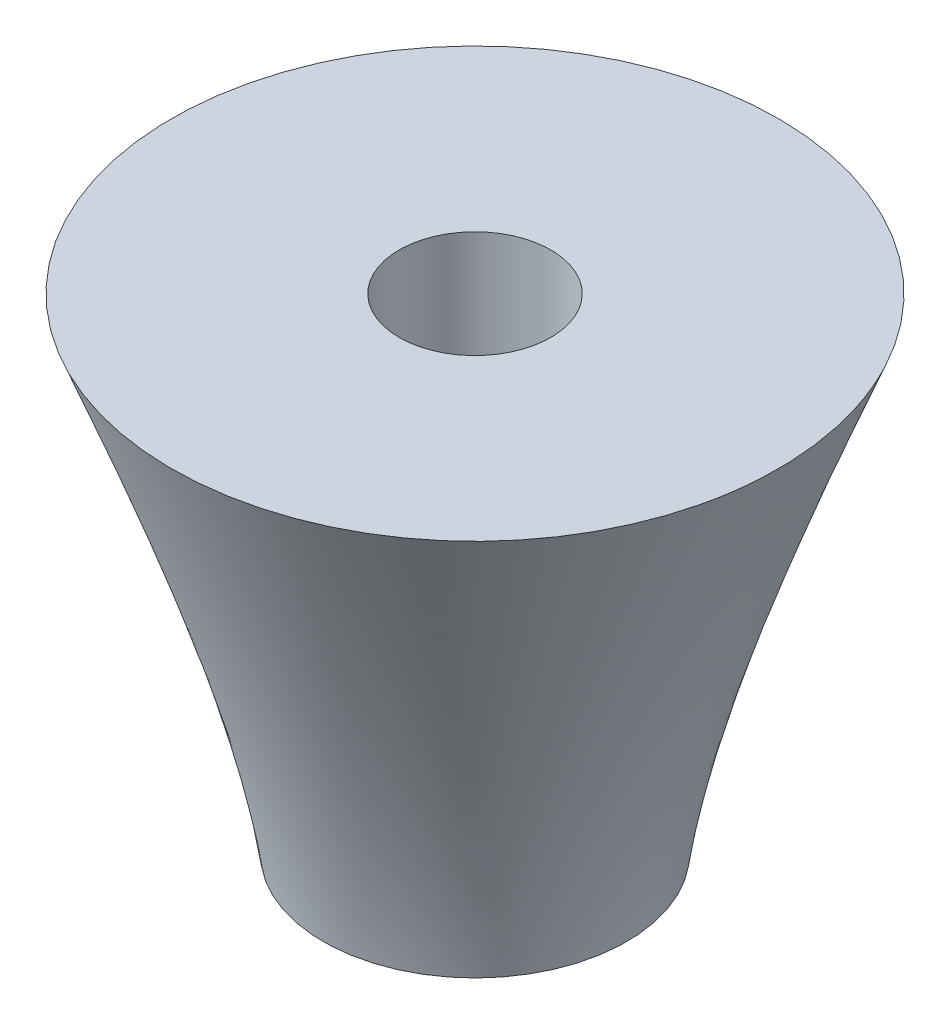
ISO-10303-21;
HEADER;
FILE_DESCRIPTION(('STEP AP214'),'2;1');
FILE_NAME('part.step','',(''),(''),'','','');
FILE_SCHEMA(('AUTOMOTIVE_DESIGN { 1 0 10303 214 1 1 1 1 }'));
ENDSEC;
DATA;
#1=APPLICATION_CONTEXT('core data for automotive mechanical design processes');
#2=APPLICATION_PROTOCOL_DEFINITION('international standard','automotive_design',2000,#1);
#3=PRODUCT_CONTEXT('',#1,'mechanical');
#4=PRODUCT('Part','Part','',(#3));
#5=PRODUCT_RELATED_PRODUCT_CATEGORY('part','',(#4));
#6=PRODUCT_DEFINITION_FORMATION('','',#4);
#7=PRODUCT_DEFINITION_CONTEXT('part definition',#1,'design');
#8=PRODUCT_DEFINITION('design','',#6,#7);
#9=PRODUCT_DEFINITION_SHAPE('','',#8);
#10=(LENGTH_UNIT() NAMED_UNIT(*) SI_UNIT(.MILLI.,.METRE.));
#11=(NAMED_UNIT(*) PLANE_ANGLE_UNIT() SI_UNIT($,.RADIAN.));
#12=(NAMED_UNIT(*) SI_UNIT($,.STERADIAN.) SOLID_ANGLE_UNIT());
#13=UNCERTAINTY_MEASURE_WITH_UNIT(LENGTH_MEASURE(1.E-05),#10,'distance_accuracy_value','');
#14=(GEOMETRIC_REPRESENTATION_CONTEXT(3) GLOBAL_UNCERTAINTY_ASSIGNED_CONTEXT((#13)) GLOBAL_UNIT_ASSIGNED_CONTEXT((#10,
#11,#12)) REPRESENTATION_CONTEXT('',''));
#15=CARTESIAN_POINT('',(0.,0.,0.));
#16=DIRECTION('',(0.,0.,1.));
#17=DIRECTION('',(1.,0.,0.));
#18=AXIS2_PLACEMENT_3D('',#15,#16,#17);
#19=CARTESIAN_POINT('',(0.,0.,0.));
#20=DIRECTION('',(0.,1.,0.));
#21=DIRECTION('',(0.,0.,1.));
#22=AXIS2_PLACEMENT_3D('',#19,#20,#21);
#23=PLANE('',#22);
#24=CARTESIAN_POINT('',(0.,0.,0.));
#25=DIRECTION('',(0.,1.,0.));
#26=DIRECTION('',(0.,0.,1.));
#27=AXIS2_PLACEMENT_3D('',#24,#25,#26);
#28=CIRCLE('',#27,1.5875);
#29=CARTESIAN_POINT('',(0.,0.,1.5875));
#30=VERTEX_POINT('',#29);
#31=EDGE_CURVE('E48',#30,#30,#28,.T.);
#32=ORIENTED_EDGE('',*,*,#31,.T.);
#33=EDGE_LOOP('',(#32));
#34=FACE_BOUND('',#33,.T.);
#35=CARTESIAN_POINT('',(0.,0.,0.));
#36=DIRECTION('',(0.,1.,0.));
#37=DIRECTION('',(0.,0.,1.));
#38=AXIS2_PLACEMENT_3D('',#35,#36,#37);
#39=CIRCLE('',#38,3.175);
#40=CARTESIAN_POINT('',(-2.02228366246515,0.,2.44765066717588));
#41=VERTEX_POINT('',#40);
#42=EDGE_CURVE('E42',#41,#41,#39,.T.);
#43=ORIENTED_EDGE('',*,*,#42,.F.);
#44=EDGE_LOOP('',(#43));
#45=FACE_BOUND('',#44,.T.);
#46=ADVANCED_FACE('F34',(#34,#45),#23,.F.);
#47=CARTESIAN_POINT('',(0.,10.16,0.));
#48=DIRECTION('',(0.,1.,0.));
#49=DIRECTION('',(0.,0.,1.));
#50=AXIS2_PLACEMENT_3D('',#47,#48,#49);
#51=PLANE('',#50);
#52=CARTESIAN_POINT('',(0.,10.16,0.));
#53=DIRECTION('',(0.,1.,0.));
#54=DIRECTION('',(0.,0.,1.));
#55=AXIS2_PLACEMENT_3D('',#52,#53,#54);
#56=CIRCLE('',#55,1.5875);
#57=CARTESIAN_POINT('',(0.,10.16,1.5875));
#58=VERTEX_POINT('',#57);
#59=EDGE_CURVE('E110',#58,#58,#56,.T.);
#60=ORIENTED_EDGE('',*,*,#59,.F.);
#61=EDGE_LOOP('',(#60));
#62=FACE_BOUND('',#61,.T.);
#63=CARTESIAN_POINT('',(0.,10.16,0.));
#64=DIRECTION('',(0.,1.,0.));
#65=DIRECTION('',(0.,0.,1.));
#66=AXIS2_PLACEMENT_3D('',#63,#64,#65);
#67=CIRCLE('',#66,6.35);
#68=CARTESIAN_POINT('',(-6.29942705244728,10.16,0.799824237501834));
#69=VERTEX_POINT('',#68);
#70=EDGE_CURVE('E11',#69,#69,#67,.T.);
#71=ORIENTED_EDGE('',*,*,#70,.T.);
#72=EDGE_LOOP('',(#71));
#73=FACE_BOUND('',#72,.T.);
#74=ADVANCED_FACE('F86',(#62,#73),#51,.T.);
#75=CARTESIAN_POINT('',(-6.29942705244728,10.16,0.799824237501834));
#76=CARTESIAN_POINT('',(-2.02228366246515,0.,2.44765066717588));
#77=CARTESIAN_POINT('',(-7.89907552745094,10.16,-11.7990298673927));
#78=CARTESIAN_POINT('',(-6.91758499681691,0.,-1.59691665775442));
#79=CARTESIAN_POINT('',(4.69977857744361,10.16,-13.3986783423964));
#80=CARTESIAN_POINT('',(-2.87301767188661,0.,-6.49221799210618));
#81=CARTESIAN_POINT('',(6.29942705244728,10.16,-0.799824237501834));
#82=CARTESIAN_POINT('',(2.02228366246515,0.,-2.44765066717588));
#83=CARTESIAN_POINT('',(7.89907552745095,10.16,11.7990298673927));
#84=CARTESIAN_POINT('',(6.91758499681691,0.,1.59691665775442));
#85=CARTESIAN_POINT('',(-4.69977857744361,10.16,13.3986783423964));
#86=CARTESIAN_POINT('',(2.87301767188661,0.,6.49221799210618));
#87=CARTESIAN_POINT('',(-6.29942705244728,10.16,0.799824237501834));
#88=CARTESIAN_POINT('',(-2.02228366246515,0.,2.44765066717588));
#89=(BOUNDED_SURFACE() B_SPLINE_SURFACE(3,1,((#75,#76),(#77,#78),(#79,#80),(#81,#82),(#83,#84),
(#85,#86),(#87,#88)),.UNSPECIFIED.,.T.,.F.,.F.) B_SPLINE_SURFACE_WITH_KNOTS((4,3,4),(2,2),(0.,
0.5,1.),(0.,1.),.UNSPECIFIED.) GEOMETRIC_REPRESENTATION_ITEM() RATIONAL_B_SPLINE_SURFACE(((1.,
1.),(0.333333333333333,0.333333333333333),(0.333333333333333,0.333333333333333),(1.,1.),
(0.333333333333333,0.333333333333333),(0.333333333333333,0.333333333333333),(1.,1.))) REPRESENTATION_ITEM('') SURFACE());
#90=CARTESIAN_POINT('',(-6.29942705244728,10.16,0.799824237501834));
#91=CARTESIAN_POINT('',(-6.2548734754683,10.0541666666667,0.816989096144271));
#92=CARTESIAN_POINT('',(-6.21031989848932,9.94833333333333,0.83415395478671));
#93=CARTESIAN_POINT('',(-6.12121274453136,9.73666666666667,0.868483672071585));
#94=CARTESIAN_POINT('',(-6.07665916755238,9.63083333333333,0.885648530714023));
#95=CARTESIAN_POINT('',(-5.98755201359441,9.41916666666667,0.919978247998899));
#96=CARTESIAN_POINT('',(-5.94299843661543,9.31333333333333,0.937143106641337));
#97=CARTESIAN_POINT('',(-5.85389128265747,9.10166666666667,0.971472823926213));
#98=CARTESIAN_POINT('',(-5.80933770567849,8.99583333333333,0.988637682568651));
#99=CARTESIAN_POINT('',(-5.72023055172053,8.78416666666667,1.02296739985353));
#100=CARTESIAN_POINT('',(-5.67567697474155,8.67833333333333,1.04013225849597));
#101=CARTESIAN_POINT('',(-5.58656982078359,8.46666666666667,1.07446197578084));
#102=CARTESIAN_POINT('',(-5.54201624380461,8.36083333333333,1.09162683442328));
#103=CARTESIAN_POINT('',(-5.45290908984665,8.14916666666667,1.12595655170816));
#104=CARTESIAN_POINT('',(-5.40835551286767,8.04333333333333,1.14312141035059));
#105=CARTESIAN_POINT('',(-5.31924835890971,7.83166666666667,1.17745112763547));
#106=CARTESIAN_POINT('',(-5.27469478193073,7.72583333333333,1.19461598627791));
#107=CARTESIAN_POINT('',(-5.18558762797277,7.51416666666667,1.22894570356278));
#108=CARTESIAN_POINT('',(-5.14103405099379,7.40833333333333,1.24611056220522));
#109=CARTESIAN_POINT('',(-5.05192689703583,7.19666666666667,1.2804402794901));
#110=CARTESIAN_POINT('',(-5.00737332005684,7.09083333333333,1.29760513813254));
#111=CARTESIAN_POINT('',(-4.91826616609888,6.87916666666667,1.33193485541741));
#112=CARTESIAN_POINT('',(-4.8737125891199,6.77333333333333,1.34909971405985));
#113=CARTESIAN_POINT('',(-4.78460543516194,6.56166666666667,1.38342943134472));
#114=CARTESIAN_POINT('',(-4.74005185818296,6.45583333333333,1.40059428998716));
#115=CARTESIAN_POINT('',(-4.650944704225,6.24416666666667,1.43492400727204));
#116=CARTESIAN_POINT('',(-4.60639112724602,6.13833333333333,1.45208886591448));
#117=CARTESIAN_POINT('',(-4.51728397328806,5.92666666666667,1.48641858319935));
#118=CARTESIAN_POINT('',(-4.47273039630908,5.82083333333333,1.50358344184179));
#119=CARTESIAN_POINT('',(-4.38362324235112,5.60916666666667,1.53791315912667));
#120=CARTESIAN_POINT('',(-4.33906966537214,5.50333333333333,1.5550780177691));
#121=CARTESIAN_POINT('',(-4.24996251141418,5.29166666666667,1.58940773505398));
#122=CARTESIAN_POINT('',(-4.2054089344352,5.18583333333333,1.60657259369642));
#123=CARTESIAN_POINT('',(-4.11630178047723,4.97416666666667,1.64090231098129));
#124=CARTESIAN_POINT('',(-4.07174820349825,4.86833333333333,1.65806716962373));
#125=CARTESIAN_POINT('',(-3.98264104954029,4.65666666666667,1.69239688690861));
#126=CARTESIAN_POINT('',(-3.93808747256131,4.55083333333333,1.70956174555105));
#127=CARTESIAN_POINT('',(-3.84898031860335,4.33916666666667,1.74389146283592));
#128=CARTESIAN_POINT('',(-3.80442674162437,4.23333333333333,1.76105632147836));
#129=CARTESIAN_POINT('',(-3.71531958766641,4.02166666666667,1.79538603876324));
#130=CARTESIAN_POINT('',(-3.67076601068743,3.91583333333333,1.81255089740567));
#131=CARTESIAN_POINT('',(-3.58165885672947,3.70416666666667,1.84688061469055));
#132=CARTESIAN_POINT('',(-3.53710527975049,3.59833333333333,1.86404547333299));
#133=CARTESIAN_POINT('',(-3.44799812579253,3.38666666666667,1.89837519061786));
#134=CARTESIAN_POINT('',(-3.40344454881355,3.28083333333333,1.9155400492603));
#135=CARTESIAN_POINT('',(-3.31433739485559,3.06916666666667,1.94986976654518));
#136=CARTESIAN_POINT('',(-3.2697838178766,2.96333333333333,1.96703462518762));
#137=CARTESIAN_POINT('',(-3.18067666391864,2.75166666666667,2.00136434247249));
#138=CARTESIAN_POINT('',(-3.13612308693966,2.64583333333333,2.01852920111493));
#139=CARTESIAN_POINT('',(-3.0470159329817,2.43416666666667,2.05285891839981));
#140=CARTESIAN_POINT('',(-3.00246235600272,2.32833333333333,2.07002377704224));
#141=CARTESIAN_POINT('',(-2.91335520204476,2.11666666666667,2.10435349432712));
#142=CARTESIAN_POINT('',(-2.86880162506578,2.01083333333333,2.12151835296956));
#143=CARTESIAN_POINT('',(-2.77969447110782,1.79916666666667,2.15584807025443));
#144=CARTESIAN_POINT('',(-2.73514089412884,1.69333333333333,2.17301292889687));
#145=CARTESIAN_POINT('',(-2.64603374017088,1.48166666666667,2.20734264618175));
#146=CARTESIAN_POINT('',(-2.6014801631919,1.37583333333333,2.22450750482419));
#147=CARTESIAN_POINT('',(-2.51237300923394,1.16416666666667,2.25883722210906));
#148=CARTESIAN_POINT('',(-2.46781943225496,1.05833333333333,2.2760020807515));
#149=CARTESIAN_POINT('',(-2.378712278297,0.846666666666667,2.31033179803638));
#150=CARTESIAN_POINT('',(-2.33415870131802,0.740833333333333,2.32749665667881));
#151=CARTESIAN_POINT('',(-2.24505154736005,0.529166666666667,2.36182637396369));
#152=CARTESIAN_POINT('',(-2.20049797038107,0.423333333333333,2.37899123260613));
#153=CARTESIAN_POINT('',(-2.11139081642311,0.211666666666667,2.413320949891));
#154=CARTESIAN_POINT('',(-2.06683723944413,0.105833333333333,2.43048580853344));
#155=CARTESIAN_POINT('',(-2.02228366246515,0.,2.44765066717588));
#156=B_SPLINE_CURVE_WITH_KNOTS('',3,(#90,#91,#92,#93,#94,#95,#96,#97,#98,#99,#100,#101,#102,
#103,#104,#105,#106,#107,#108,#109,#110,#111,#112,#113,#114,#115,#116,#117,#118,#119,#120,#121,
#122,#123,#124,#125,#126,#127,#128,#129,#130,#131,#132,#133,#134,#135,#136,#137,#138,#139,#140,
#141,#142,#143,#144,#145,#146,#147,#148,#149,#150,#151,#152,#153,#154,#155),.UNSPECIFIED.,.F.,
.F.,(4,2,2,2,2,2,2,2,2,2,2,2,2,2,2,2,2,2,2,2,2,2,2,2,2,2,2,2,2,2,2,2,4),(0.,0.348314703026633,
0.696629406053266,1.0449441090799,1.39325881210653,1.74157351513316,2.0898882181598,
2.43820292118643,2.78651762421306,3.13483232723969,3.48314703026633,3.83146173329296,
4.17977643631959,4.52809113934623,4.87640584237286,5.22472054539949,5.57303524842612,
5.92134995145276,6.26966465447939,6.61797935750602,6.96629406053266,7.31460876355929,
7.66292346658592,8.01123816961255,8.35955287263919,8.70786757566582,9.05618227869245,
9.40449698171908,9.75281168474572,10.1011263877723,10.449441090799,10.7977557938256,
11.1460704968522),.UNSPECIFIED.);
#157=EDGE_CURVE('BSEAM68',#69,#41,#156,.T.);
#158=ORIENTED_EDGE('',*,*,#70,.F.);
#159=ORIENTED_EDGE('',*,*,#42,.T.);
#160=ORIENTED_EDGE('',*,*,#157,.T.);
#161=ORIENTED_EDGE('',*,*,#157,.F.);
#162=EDGE_LOOP('',(#158,#160,#159,#161));
#163=FACE_BOUND('',#162,.T.);
#164=ADVANCED_FACE('F68',(#163),#89,.T.);
#165=CARTESIAN_POINT('',(0.,-9.99999999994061E-05,0.));
#166=DIRECTION('',(0.,1.,0.));
#167=DIRECTION('',(0.,0.,1.));
#168=AXIS2_PLACEMENT_3D('',#165,#166,#167);
#169=CYLINDRICAL_SURFACE('',#168,1.5875);
#170=ORIENTED_EDGE('',*,*,#59,.T.);
#171=EDGE_LOOP('',(#170));
#172=FACE_BOUND('',#171,.T.);
#173=ORIENTED_EDGE('',*,*,#31,.F.);
#174=EDGE_LOOP('',(#173));
#175=FACE_BOUND('',#174,.T.);
#176=ADVANCED_FACE('F85',(#172,#175),#169,.F.);
#177=CLOSED_SHELL('',(#46,#74,#164,#176));
#178=MANIFOLD_SOLID_BREP('B2',#177);
#179=ADVANCED_BREP_SHAPE_REPRESENTATION('',(#18,#178),#14);
#180=SHAPE_DEFINITION_REPRESENTATION(#9,#179);
ENDSEC;
END-ISO-10303-21;
